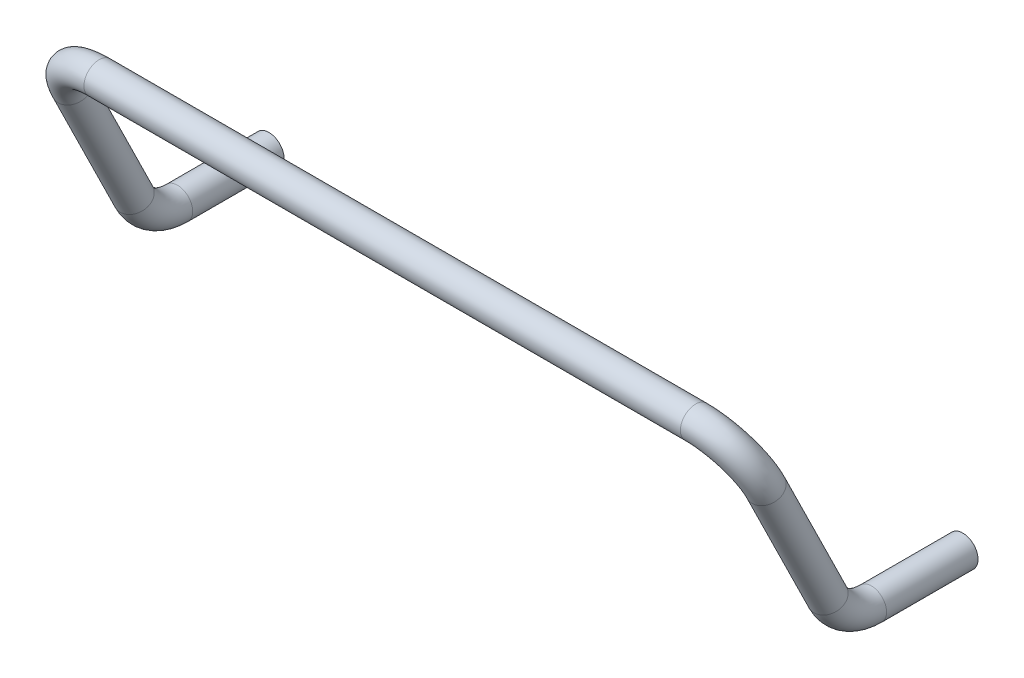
from build123d import *

# Parameters (mm, degrees)
ESQUISSE2_R   = 12.5
ESQUISSE2_R_2 = 11


with BuildPart() as part:
    # Base-Balayage: sweep along a curve in space
    with BuildLine() as base_balayage_path:
        Line((0, 0, 0), (0, 0, 75.106562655))
        ThreePointArc((0, 22.334113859, 110.994115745), (0, 6.03946816, 96.241421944), (0, 0, 75.106562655))
        Line((0, 22.334113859, 110.994115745), (0, 125.606435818, 161.830601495))
        ThreePointArc((0, 125.606435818, 161.830601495), (11.715728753, 150.982767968, 174.322269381), (40, 161.493988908, 179.496487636))
        Line((40, 161.493988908, 179.496487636), (285, 161.493988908, 179.496487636))
    # Esquisse2 → Base-Balayage (sweep)
    with BuildSketch(Plane.XY):
        Circle(ESQUISSE2_R)
        Circle(ESQUISSE2_R_2, mode=Mode.SUBTRACT)
    sweep(path=base_balayage_path.line)

    # Tout sym_triser1: part across face


with BuildPart() as part_1:
    add(part.part)
    add(part.part.mirror(Plane(origin=(285, 161.493988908, 179.496487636), x_dir=(0, 0, 1), z_dir=(1, 0, 0))))


solid = part_1.part
